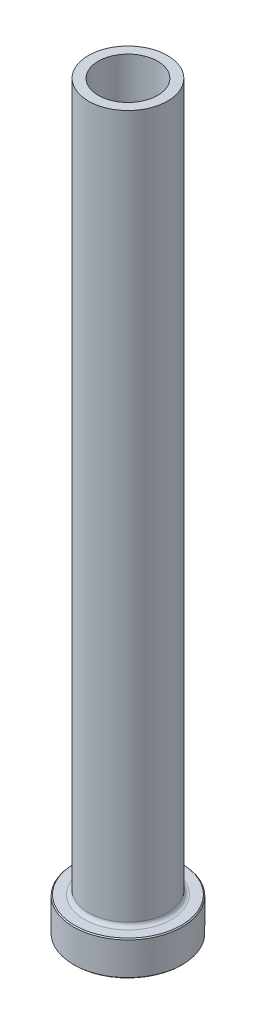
ISO-10303-21;
HEADER;
FILE_DESCRIPTION(('STEP AP214'),'2;1');
FILE_NAME('part.step','',(''),(''),'','','');
FILE_SCHEMA(('AUTOMOTIVE_DESIGN { 1 0 10303 214 1 1 1 1 }'));
ENDSEC;
DATA;
#1=APPLICATION_CONTEXT('core data for automotive mechanical design processes');
#2=APPLICATION_PROTOCOL_DEFINITION('international standard','automotive_design',2000,#1);
#3=PRODUCT_CONTEXT('',#1,'mechanical');
#4=PRODUCT('Part','Part','',(#3));
#5=PRODUCT_RELATED_PRODUCT_CATEGORY('part','',(#4));
#6=PRODUCT_DEFINITION_FORMATION('','',#4);
#7=PRODUCT_DEFINITION_CONTEXT('part definition',#1,'design');
#8=PRODUCT_DEFINITION('design','',#6,#7);
#9=PRODUCT_DEFINITION_SHAPE('','',#8);
#10=(LENGTH_UNIT() NAMED_UNIT(*) SI_UNIT(.MILLI.,.METRE.));
#11=(NAMED_UNIT(*) PLANE_ANGLE_UNIT() SI_UNIT($,.RADIAN.));
#12=(NAMED_UNIT(*) SI_UNIT($,.STERADIAN.) SOLID_ANGLE_UNIT());
#13=UNCERTAINTY_MEASURE_WITH_UNIT(LENGTH_MEASURE(1.E-05),#10,'distance_accuracy_value','');
#14=(GEOMETRIC_REPRESENTATION_CONTEXT(3) GLOBAL_UNCERTAINTY_ASSIGNED_CONTEXT((#13)) GLOBAL_UNIT_ASSIGNED_CONTEXT((#10,
#11,#12)) REPRESENTATION_CONTEXT('',''));
#15=CARTESIAN_POINT('',(0.,0.,0.));
#16=DIRECTION('',(0.,0.,1.));
#17=DIRECTION('',(1.,0.,0.));
#18=AXIS2_PLACEMENT_3D('',#15,#16,#17);
#19=CARTESIAN_POINT('',(0.,92.1876809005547,0.));
#20=DIRECTION('',(0.,1.,0.));
#21=DIRECTION('',(0.,0.,1.));
#22=AXIS2_PLACEMENT_3D('',#19,#20,#21);
#23=CYLINDRICAL_SURFACE('',#22,6.);
#24=CARTESIAN_POINT('',(0.,150.,0.));
#25=DIRECTION('',(0.,1.,0.));
#26=DIRECTION('',(0.,0.,1.));
#27=AXIS2_PLACEMENT_3D('',#24,#25,#26);
#28=CIRCLE('',#27,6.);
#29=CARTESIAN_POINT('',(0.,150.,6.));
#30=VERTEX_POINT('',#29);
#31=EDGE_CURVE('E62',#30,#30,#28,.T.);
#32=ORIENTED_EDGE('',*,*,#31,.T.);
#33=EDGE_LOOP('',(#32));
#34=FACE_BOUND('',#33,.T.);
#35=CARTESIAN_POINT('',(0.,95.,0.));
#36=DIRECTION('',(0.,1.,0.));
#37=DIRECTION('',(0.,0.,1.));
#38=AXIS2_PLACEMENT_3D('',#35,#36,#37);
#39=CIRCLE('',#38,6.);
#40=CARTESIAN_POINT('',(0.,95.,6.));
#41=VERTEX_POINT('',#40);
#42=EDGE_CURVE('E71',#41,#41,#39,.T.);
#43=ORIENTED_EDGE('',*,*,#42,.F.);
#44=EDGE_LOOP('',(#43));
#45=FACE_BOUND('',#44,.T.);
#46=ADVANCED_FACE('F30',(#34,#45),#23,.F.);
#47=CARTESIAN_POINT('',(-6.,150.,0.));
#48=DIRECTION('',(0.,1.,0.));
#49=DIRECTION('',(0.,0.,1.));
#50=AXIS2_PLACEMENT_3D('',#47,#48,#49);
#51=PLANE('',#50);
#52=CARTESIAN_POINT('',(0.,150.,0.));
#53=DIRECTION('',(0.,1.,0.));
#54=DIRECTION('',(0.,0.,1.));
#55=AXIS2_PLACEMENT_3D('',#52,#53,#54);
#56=CIRCLE('',#55,8.00000000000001);
#57=CARTESIAN_POINT('',(0.,150.,8.00000000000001));
#58=VERTEX_POINT('',#57);
#59=EDGE_CURVE('E65',#58,#58,#56,.T.);
#60=ORIENTED_EDGE('',*,*,#59,.T.);
#61=EDGE_LOOP('',(#60));
#62=FACE_BOUND('',#61,.T.);
#63=ORIENTED_EDGE('',*,*,#31,.F.);
#64=EDGE_LOOP('',(#63));
#65=FACE_BOUND('',#64,.T.);
#66=ADVANCED_FACE('F79',(#62,#65),#51,.T.);
#67=CARTESIAN_POINT('',(0.,92.1876809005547,0.));
#68=DIRECTION('',(0.,1.,0.));
#69=DIRECTION('',(0.,0.,1.));
#70=AXIS2_PLACEMENT_3D('',#67,#68,#69);
#71=CYLINDRICAL_SURFACE('',#70,8.);
#72=CARTESIAN_POINT('',(0.,7.8,0.));
#73=DIRECTION('',(0.,1.,0.));
#74=DIRECTION('',(0.,0.,1.));
#75=AXIS2_PLACEMENT_3D('',#72,#73,#74);
#76=CIRCLE('',#75,8.);
#77=CARTESIAN_POINT('',(0.,7.8,8.));
#78=VERTEX_POINT('',#77);
#79=EDGE_CURVE('E59',#78,#78,#76,.T.);
#80=ORIENTED_EDGE('',*,*,#79,.T.);
#81=EDGE_LOOP('',(#80));
#82=FACE_BOUND('',#81,.T.);
#83=ORIENTED_EDGE('',*,*,#59,.F.);
#84=EDGE_LOOP('',(#83));
#85=FACE_BOUND('',#84,.T.);
#86=ADVANCED_FACE('F85',(#82,#85),#71,.T.);
#87=CARTESIAN_POINT('',(-7.99999999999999,7.,0.));
#88=DIRECTION('',(0.,1.,0.));
#89=DIRECTION('',(0.,0.,1.));
#90=AXIS2_PLACEMENT_3D('',#87,#88,#89);
#91=PLANE('',#90);
#92=CARTESIAN_POINT('',(0.,7.,0.));
#93=DIRECTION('',(0.,1.,0.));
#94=DIRECTION('',(0.,0.,1.));
#95=AXIS2_PLACEMENT_3D('',#92,#93,#94);
#96=CIRCLE('',#95,10.8);
#97=CARTESIAN_POINT('',(0.,7.,10.8));
#98=VERTEX_POINT('',#97);
#99=EDGE_CURVE('E53',#98,#98,#96,.T.);
#100=ORIENTED_EDGE('',*,*,#99,.T.);
#101=EDGE_LOOP('',(#100));
#102=FACE_BOUND('',#101,.T.);
#103=CARTESIAN_POINT('',(0.,7.,0.));
#104=DIRECTION('',(0.,1.,0.));
#105=DIRECTION('',(0.,0.,1.));
#106=AXIS2_PLACEMENT_3D('',#103,#104,#105);
#107=CIRCLE('',#106,8.8);
#108=CARTESIAN_POINT('',(0.,7.,8.8));
#109=VERTEX_POINT('',#108);
#110=EDGE_CURVE('E56',#109,#109,#107,.F.);
#111=ORIENTED_EDGE('',*,*,#110,.T.);
#112=EDGE_LOOP('',(#111));
#113=FACE_BOUND('',#112,.T.);
#114=ADVANCED_FACE('F111',(#102,#113),#91,.T.);
#115=CARTESIAN_POINT('',(0.,92.1876809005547,0.));
#116=DIRECTION('',(0.,1.,0.));
#117=DIRECTION('',(0.,0.,1.));
#118=AXIS2_PLACEMENT_3D('',#115,#116,#117);
#119=CYLINDRICAL_SURFACE('',#118,11.);
#120=CARTESIAN_POINT('',(0.,6.79999999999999,0.));
#121=DIRECTION('',(0.,1.,0.));
#122=DIRECTION('',(0.,0.,1.));
#123=AXIS2_PLACEMENT_3D('',#120,#121,#122);
#124=CIRCLE('',#123,11.);
#125=CARTESIAN_POINT('',(0.,6.79999999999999,11.));
#126=VERTEX_POINT('',#125);
#127=EDGE_CURVE('E45',#126,#126,#124,.F.);
#128=ORIENTED_EDGE('',*,*,#127,.T.);
#129=EDGE_LOOP('',(#128));
#130=FACE_BOUND('',#129,.T.);
#131=CARTESIAN_POINT('',(0.,0.200000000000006,0.));
#132=DIRECTION('',(0.,-1.,0.));
#133=DIRECTION('',(0.,0.,-1.));
#134=AXIS2_PLACEMENT_3D('',#131,#132,#133);
#135=CIRCLE('',#134,11.);
#136=CARTESIAN_POINT('',(0.,0.200000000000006,-11.));
#137=VERTEX_POINT('',#136);
#138=EDGE_CURVE('E50',#137,#137,#135,.F.);
#139=ORIENTED_EDGE('',*,*,#138,.T.);
#140=EDGE_LOOP('',(#139));
#141=FACE_BOUND('',#140,.T.);
#142=ADVANCED_FACE('F108',(#130,#141),#119,.T.);
#143=CARTESIAN_POINT('',(-11.,0.,0.));
#144=DIRECTION('',(0.,-1.,0.));
#145=DIRECTION('',(0.,0.,-1.));
#146=AXIS2_PLACEMENT_3D('',#143,#144,#145);
#147=PLANE('',#146);
#148=CARTESIAN_POINT('',(0.,0.,0.));
#149=DIRECTION('',(0.,-1.,0.));
#150=DIRECTION('',(0.,0.,-1.));
#151=AXIS2_PLACEMENT_3D('',#148,#149,#150);
#152=CIRCLE('',#151,6.74999999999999);
#153=CARTESIAN_POINT('',(0.,0.,-6.74999999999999));
#154=VERTEX_POINT('',#153);
#155=EDGE_CURVE('E37',#154,#154,#152,.F.);
#156=ORIENTED_EDGE('',*,*,#155,.T.);
#157=EDGE_LOOP('',(#156));
#158=FACE_BOUND('',#157,.T.);
#159=CARTESIAN_POINT('',(0.,0.,0.));
#160=DIRECTION('',(0.,-1.,0.));
#161=DIRECTION('',(0.,0.,-1.));
#162=AXIS2_PLACEMENT_3D('',#159,#160,#161);
#163=CIRCLE('',#162,10.8);
#164=CARTESIAN_POINT('',(0.,0.,-10.8));
#165=VERTEX_POINT('',#164);
#166=EDGE_CURVE('E41',#165,#165,#163,.T.);
#167=ORIENTED_EDGE('',*,*,#166,.T.);
#168=EDGE_LOOP('',(#167));
#169=FACE_BOUND('',#168,.T.);
#170=ADVANCED_FACE('F110',(#158,#169),#147,.T.);
#171=CARTESIAN_POINT('',(0.,92.1876809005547,0.));
#172=DIRECTION('',(0.,1.,0.));
#173=DIRECTION('',(0.,0.,1.));
#174=AXIS2_PLACEMENT_3D('',#171,#172,#173);
#175=CYLINDRICAL_SURFACE('',#174,6.25);
#176=CARTESIAN_POINT('',(0.,0.5,0.));
#177=DIRECTION('',(0.,-1.,0.));
#178=DIRECTION('',(0.,0.,-1.));
#179=AXIS2_PLACEMENT_3D('',#176,#177,#178);
#180=CIRCLE('',#179,6.25);
#181=CARTESIAN_POINT('',(0.,0.5,-6.25));
#182=VERTEX_POINT('',#181);
#183=EDGE_CURVE('E10',#182,#182,#180,.T.);
#184=ORIENTED_EDGE('',*,*,#183,.T.);
#185=EDGE_LOOP('',(#184));
#186=FACE_BOUND('',#185,.T.);
#187=CARTESIAN_POINT('',(0.,83.,0.));
#188=DIRECTION('',(0.,1.,0.));
#189=DIRECTION('',(0.,0.,1.));
#190=AXIS2_PLACEMENT_3D('',#187,#188,#189);
#191=CIRCLE('',#190,6.25);
#192=CARTESIAN_POINT('',(0.,83.,6.25));
#193=VERTEX_POINT('',#192);
#194=EDGE_CURVE('E68',#193,#193,#191,.T.);
#195=ORIENTED_EDGE('',*,*,#194,.T.);
#196=EDGE_LOOP('',(#195));
#197=FACE_BOUND('',#196,.T.);
#198=ADVANCED_FACE('F118',(#186,#197),#175,.F.);
#199=CARTESIAN_POINT('',(0.,83.,0.));
#200=DIRECTION('',(0.,-1.,0.));
#201=DIRECTION('',(0.,0.,-1.));
#202=AXIS2_PLACEMENT_3D('',#199,#200,#201);
#203=CONICAL_SURFACE('',#202,6.25,0.0208303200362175);
#204=ORIENTED_EDGE('',*,*,#42,.T.);
#205=EDGE_LOOP('',(#204));
#206=FACE_BOUND('',#205,.T.);
#207=ORIENTED_EDGE('',*,*,#194,.F.);
#208=EDGE_LOOP('',(#207));
#209=FACE_BOUND('',#208,.T.);
#210=ADVANCED_FACE('F75',(#206,#209),#203,.F.);
#211=CARTESIAN_POINT('',(0.,7.8,0.));
#212=DIRECTION('',(0.,1.,0.));
#213=DIRECTION('',(0.,0.,1.));
#214=AXIS2_PLACEMENT_3D('',#211,#212,#213);
#215=TOROIDAL_SURFACE('',#214,8.8,0.8);
#216=ORIENTED_EDGE('',*,*,#110,.F.);
#217=EDGE_LOOP('',(#216));
#218=FACE_BOUND('',#217,.T.);
#219=ORIENTED_EDGE('',*,*,#79,.F.);
#220=EDGE_LOOP('',(#219));
#221=FACE_BOUND('',#220,.T.);
#222=ADVANCED_FACE('F90',(#218,#221),#215,.F.);
#223=CARTESIAN_POINT('',(0.,7.00000000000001,0.));
#224=DIRECTION('',(0.,-1.,0.));
#225=DIRECTION('',(0.,0.,-1.));
#226=AXIS2_PLACEMENT_3D('',#223,#224,#225);
#227=CONICAL_SURFACE('',#226,10.8,0.785398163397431);
#228=ORIENTED_EDGE('',*,*,#127,.F.);
#229=EDGE_LOOP('',(#228));
#230=FACE_BOUND('',#229,.T.);
#231=ORIENTED_EDGE('',*,*,#99,.F.);
#232=EDGE_LOOP('',(#231));
#233=FACE_BOUND('',#232,.T.);
#234=ADVANCED_FACE('F93',(#230,#233),#227,.T.);
#235=CARTESIAN_POINT('',(0.,0.200000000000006,0.));
#236=DIRECTION('',(0.,1.,0.));
#237=DIRECTION('',(0.,0.,1.));
#238=AXIS2_PLACEMENT_3D('',#235,#236,#237);
#239=CONICAL_SURFACE('',#238,11.,0.785398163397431);
#240=ORIENTED_EDGE('',*,*,#166,.F.);
#241=EDGE_LOOP('',(#240));
#242=FACE_BOUND('',#241,.T.);
#243=ORIENTED_EDGE('',*,*,#138,.F.);
#244=EDGE_LOOP('',(#243));
#245=FACE_BOUND('',#244,.T.);
#246=ADVANCED_FACE('F96',(#242,#245),#239,.T.);
#247=CARTESIAN_POINT('',(0.,0.,0.));
#248=DIRECTION('',(0.,-1.,0.));
#249=DIRECTION('',(0.,0.,-1.));
#250=AXIS2_PLACEMENT_3D('',#247,#248,#249);
#251=CONICAL_SURFACE('',#250,6.74999999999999,0.785398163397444);
#252=ORIENTED_EDGE('',*,*,#183,.F.);
#253=EDGE_LOOP('',(#252));
#254=FACE_BOUND('',#253,.T.);
#255=ORIENTED_EDGE('',*,*,#155,.F.);
#256=EDGE_LOOP('',(#255));
#257=FACE_BOUND('',#256,.T.);
#258=ADVANCED_FACE('F32',(#254,#257),#251,.F.);
#259=CLOSED_SHELL('',(#46,#66,#86,#114,#142,#170,#198,#210,#222,#234,#246,#258));
#260=MANIFOLD_SOLID_BREP('B2',#259);
#261=ADVANCED_BREP_SHAPE_REPRESENTATION('',(#18,#260),#14);
#262=SHAPE_DEFINITION_REPRESENTATION(#9,#261);
ENDSEC;
END-ISO-10303-21;
